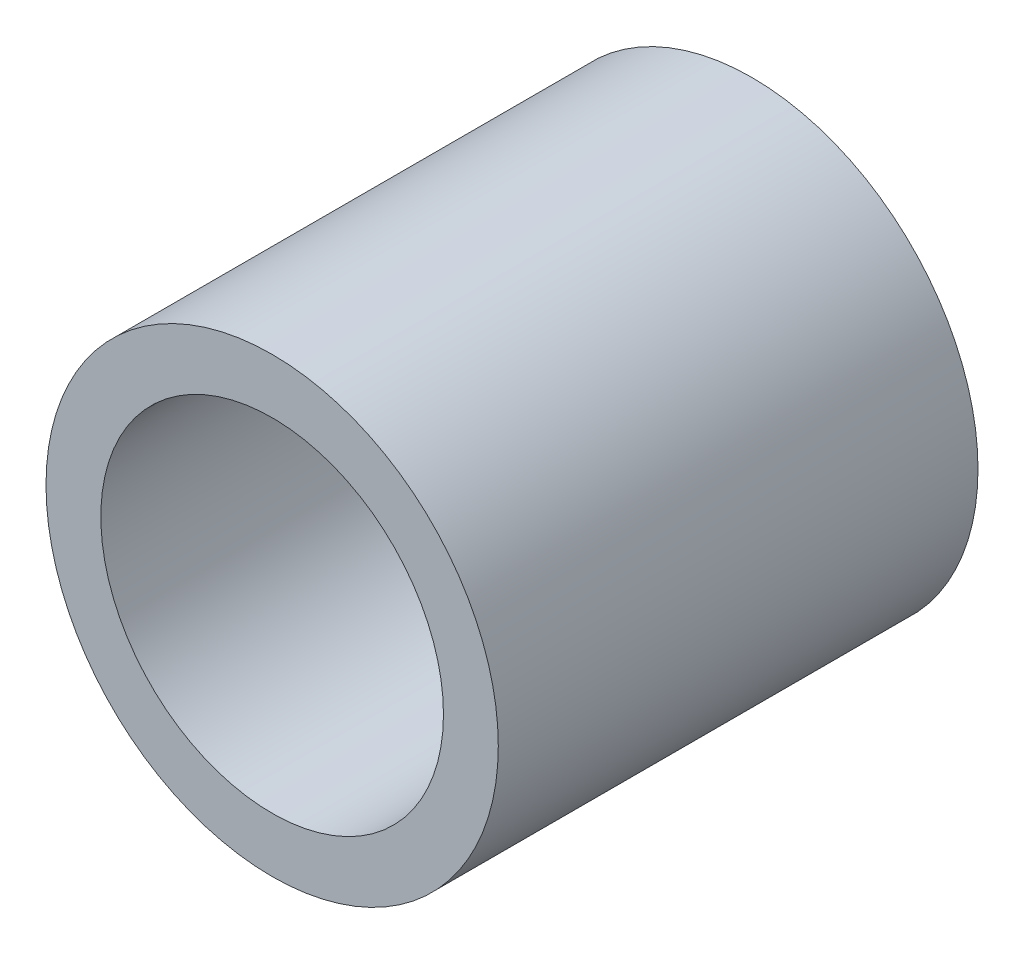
ISO-10303-21;
HEADER;
FILE_DESCRIPTION(('STEP AP214'),'2;1');
FILE_NAME('part.step','',(''),(''),'','','');
FILE_SCHEMA(('AUTOMOTIVE_DESIGN { 1 0 10303 214 1 1 1 1 }'));
ENDSEC;
DATA;
#1=APPLICATION_CONTEXT('core data for automotive mechanical design processes');
#2=APPLICATION_PROTOCOL_DEFINITION('international standard','automotive_design',2000,#1);
#3=PRODUCT_CONTEXT('',#1,'mechanical');
#4=PRODUCT('Part','Part','',(#3));
#5=PRODUCT_RELATED_PRODUCT_CATEGORY('part','',(#4));
#6=PRODUCT_DEFINITION_FORMATION('','',#4);
#7=PRODUCT_DEFINITION_CONTEXT('part definition',#1,'design');
#8=PRODUCT_DEFINITION('design','',#6,#7);
#9=PRODUCT_DEFINITION_SHAPE('','',#8);
#10=(LENGTH_UNIT() NAMED_UNIT(*) SI_UNIT(.MILLI.,.METRE.));
#11=(NAMED_UNIT(*) PLANE_ANGLE_UNIT() SI_UNIT($,.RADIAN.));
#12=(NAMED_UNIT(*) SI_UNIT($,.STERADIAN.) SOLID_ANGLE_UNIT());
#13=UNCERTAINTY_MEASURE_WITH_UNIT(LENGTH_MEASURE(1.E-05),#10,'distance_accuracy_value','');
#14=(GEOMETRIC_REPRESENTATION_CONTEXT(3) GLOBAL_UNCERTAINTY_ASSIGNED_CONTEXT((#13)) GLOBAL_UNIT_ASSIGNED_CONTEXT((#10,
#11,#12)) REPRESENTATION_CONTEXT('',''));
#15=CARTESIAN_POINT('',(0.,0.,0.));
#16=DIRECTION('',(0.,0.,1.));
#17=DIRECTION('',(1.,0.,0.));
#18=AXIS2_PLACEMENT_3D('',#15,#16,#17);
#19=CARTESIAN_POINT('',(0.,0.,35.));
#20=DIRECTION('',(0.,0.,1.));
#21=DIRECTION('',(1.,0.,0.));
#22=AXIS2_PLACEMENT_3D('',#19,#20,#21);
#23=PLANE('',#22);
#24=CARTESIAN_POINT('',(0.,0.,35.));
#25=DIRECTION('',(0.,0.,1.));
#26=DIRECTION('',(1.,0.,0.));
#27=AXIS2_PLACEMENT_3D('',#24,#25,#26);
#28=CIRCLE('',#27,16.5);
#29=CARTESIAN_POINT('',(16.5,0.,35.));
#30=VERTEX_POINT('',#29);
#31=EDGE_CURVE('E10',#30,#30,#28,.T.);
#32=ORIENTED_EDGE('',*,*,#31,.T.);
#33=EDGE_LOOP('',(#32));
#34=FACE_BOUND('',#33,.T.);
#35=CARTESIAN_POINT('',(0.,0.,35.));
#36=DIRECTION('',(0.,0.,1.));
#37=DIRECTION('',(1.,0.,0.));
#38=AXIS2_PLACEMENT_3D('',#35,#36,#37);
#39=CIRCLE('',#38,12.5);
#40=CARTESIAN_POINT('',(12.5,0.,35.));
#41=VERTEX_POINT('',#40);
#42=EDGE_CURVE('E43',#41,#41,#39,.T.);
#43=ORIENTED_EDGE('',*,*,#42,.F.);
#44=EDGE_LOOP('',(#43));
#45=FACE_BOUND('',#44,.T.);
#46=ADVANCED_FACE('F32',(#34,#45),#23,.T.);
#47=CARTESIAN_POINT('',(0.,0.,0.));
#48=DIRECTION('',(0.,0.,1.));
#49=DIRECTION('',(1.,0.,0.));
#50=AXIS2_PLACEMENT_3D('',#47,#48,#49);
#51=PLANE('',#50);
#52=CARTESIAN_POINT('',(0.,0.,0.));
#53=DIRECTION('',(0.,0.,1.));
#54=DIRECTION('',(1.,0.,0.));
#55=AXIS2_PLACEMENT_3D('',#52,#53,#54);
#56=CIRCLE('',#55,16.5);
#57=CARTESIAN_POINT('',(16.5,0.,0.));
#58=VERTEX_POINT('',#57);
#59=EDGE_CURVE('E39',#58,#58,#56,.T.);
#60=ORIENTED_EDGE('',*,*,#59,.F.);
#61=EDGE_LOOP('',(#60));
#62=FACE_BOUND('',#61,.T.);
#63=CARTESIAN_POINT('',(0.,0.,0.));
#64=DIRECTION('',(0.,0.,1.));
#65=DIRECTION('',(1.,0.,0.));
#66=AXIS2_PLACEMENT_3D('',#63,#64,#65);
#67=CIRCLE('',#66,12.5);
#68=CARTESIAN_POINT('',(12.5,0.,0.));
#69=VERTEX_POINT('',#68);
#70=EDGE_CURVE('E47',#69,#69,#67,.T.);
#71=ORIENTED_EDGE('',*,*,#70,.T.);
#72=EDGE_LOOP('',(#71));
#73=FACE_BOUND('',#72,.T.);
#74=ADVANCED_FACE('F53',(#62,#73),#51,.F.);
#75=CARTESIAN_POINT('',(0.,0.,35.));
#76=DIRECTION('',(0.,0.,-1.));
#77=DIRECTION('',(-1.,0.,0.));
#78=AXIS2_PLACEMENT_3D('',#75,#76,#77);
#79=CYLINDRICAL_SURFACE('',#78,16.5);
#80=ORIENTED_EDGE('',*,*,#31,.F.);
#81=EDGE_LOOP('',(#80));
#82=FACE_BOUND('',#81,.T.);
#83=ORIENTED_EDGE('',*,*,#59,.T.);
#84=EDGE_LOOP('',(#83));
#85=FACE_BOUND('',#84,.T.);
#86=ADVANCED_FACE('F34',(#82,#85),#79,.T.);
#87=CARTESIAN_POINT('',(0.,0.,35.));
#88=DIRECTION('',(0.,0.,-1.));
#89=DIRECTION('',(-1.,0.,0.));
#90=AXIS2_PLACEMENT_3D('',#87,#88,#89);
#91=CYLINDRICAL_SURFACE('',#90,12.5);
#92=ORIENTED_EDGE('',*,*,#42,.T.);
#93=EDGE_LOOP('',(#92));
#94=FACE_BOUND('',#93,.T.);
#95=ORIENTED_EDGE('',*,*,#70,.F.);
#96=EDGE_LOOP('',(#95));
#97=FACE_BOUND('',#96,.T.);
#98=ADVANCED_FACE('F55',(#94,#97),#91,.F.);
#99=CLOSED_SHELL('',(#46,#74,#86,#98));
#100=MANIFOLD_SOLID_BREP('B2',#99);
#101=ADVANCED_BREP_SHAPE_REPRESENTATION('',(#18,#100),#14);
#102=SHAPE_DEFINITION_REPRESENTATION(#9,#101);
ENDSEC;
END-ISO-10303-21;
